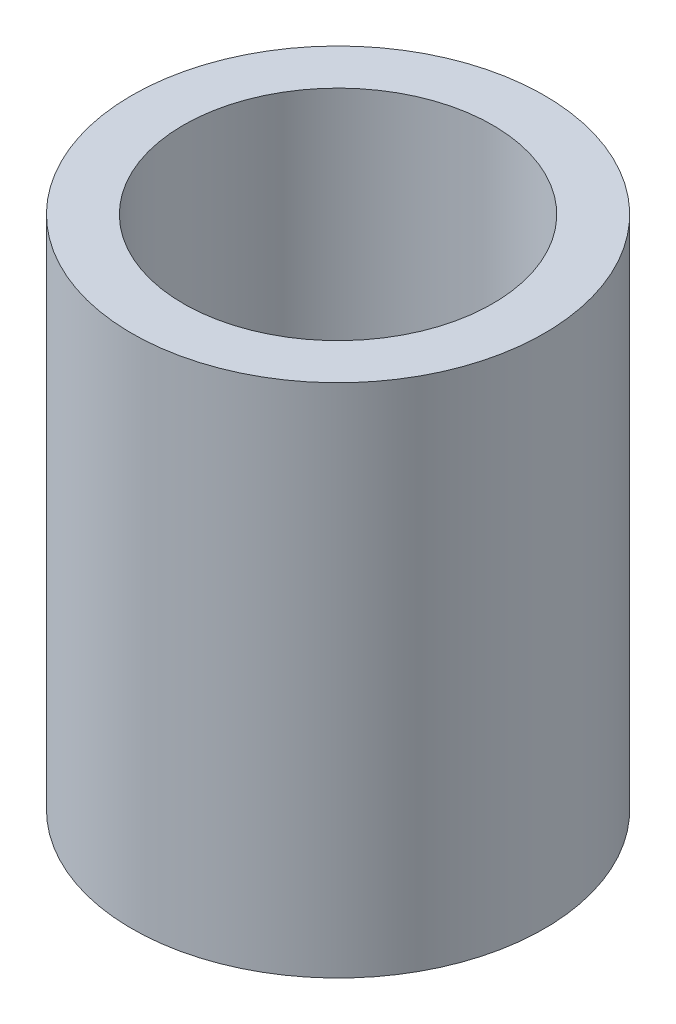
ISO-10303-21;
HEADER;
FILE_DESCRIPTION(('STEP AP214'),'2;1');
FILE_NAME('part.step','',(''),(''),'','','');
FILE_SCHEMA(('AUTOMOTIVE_DESIGN { 1 0 10303 214 1 1 1 1 }'));
ENDSEC;
DATA;
#1=APPLICATION_CONTEXT('core data for automotive mechanical design processes');
#2=APPLICATION_PROTOCOL_DEFINITION('international standard','automotive_design',2000,#1);
#3=PRODUCT_CONTEXT('',#1,'mechanical');
#4=PRODUCT('Part','Part','',(#3));
#5=PRODUCT_RELATED_PRODUCT_CATEGORY('part','',(#4));
#6=PRODUCT_DEFINITION_FORMATION('','',#4);
#7=PRODUCT_DEFINITION_CONTEXT('part definition',#1,'design');
#8=PRODUCT_DEFINITION('design','',#6,#7);
#9=PRODUCT_DEFINITION_SHAPE('','',#8);
#10=(LENGTH_UNIT() NAMED_UNIT(*) SI_UNIT(.MILLI.,.METRE.));
#11=(NAMED_UNIT(*) PLANE_ANGLE_UNIT() SI_UNIT($,.RADIAN.));
#12=(NAMED_UNIT(*) SI_UNIT($,.STERADIAN.) SOLID_ANGLE_UNIT());
#13=UNCERTAINTY_MEASURE_WITH_UNIT(LENGTH_MEASURE(1.E-05),#10,'distance_accuracy_value','');
#14=(GEOMETRIC_REPRESENTATION_CONTEXT(3) GLOBAL_UNCERTAINTY_ASSIGNED_CONTEXT((#13)) GLOBAL_UNIT_ASSIGNED_CONTEXT((#10,
#11,#12)) REPRESENTATION_CONTEXT('',''));
#15=CARTESIAN_POINT('',(0.,0.,0.));
#16=DIRECTION('',(0.,0.,1.));
#17=DIRECTION('',(1.,0.,0.));
#18=AXIS2_PLACEMENT_3D('',#15,#16,#17);
#19=CARTESIAN_POINT('',(0.,83.5390005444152,0.));
#20=DIRECTION('',(0.,1.,0.));
#21=DIRECTION('',(-1.,0.,0.));
#22=AXIS2_PLACEMENT_3D('',#19,#20,#21);
#23=CYLINDRICAL_SURFACE('',#22,15.);
#24=CARTESIAN_POINT('',(0.,0.,0.));
#25=DIRECTION('',(0.,1.,0.));
#26=DIRECTION('',(-1.,0.,0.));
#27=AXIS2_PLACEMENT_3D('',#24,#25,#26);
#28=CIRCLE('',#27,15.);
#29=CARTESIAN_POINT('',(-15.,0.,0.));
#30=VERTEX_POINT('',#29);
#31=EDGE_CURVE('E10',#30,#30,#28,.T.);
#32=ORIENTED_EDGE('',*,*,#31,.F.);
#33=EDGE_LOOP('',(#32));
#34=FACE_BOUND('',#33,.T.);
#35=CARTESIAN_POINT('',(0.,50.,0.));
#36=DIRECTION('',(0.,1.,0.));
#37=DIRECTION('',(-1.,0.,0.));
#38=AXIS2_PLACEMENT_3D('',#35,#36,#37);
#39=CIRCLE('',#38,15.);
#40=CARTESIAN_POINT('',(-15.,50.,0.));
#41=VERTEX_POINT('',#40);
#42=EDGE_CURVE('E42',#41,#41,#39,.T.);
#43=ORIENTED_EDGE('',*,*,#42,.T.);
#44=EDGE_LOOP('',(#43));
#45=FACE_BOUND('',#44,.T.);
#46=ADVANCED_FACE('F28',(#34,#45),#23,.F.);
#47=CARTESIAN_POINT('',(15.,0.,0.));
#48=DIRECTION('',(0.,1.,0.));
#49=DIRECTION('',(-1.,0.,0.));
#50=AXIS2_PLACEMENT_3D('',#47,#48,#49);
#51=PLANE('',#50);
#52=CARTESIAN_POINT('',(0.,0.,0.));
#53=DIRECTION('',(0.,1.,0.));
#54=DIRECTION('',(-1.,0.,0.));
#55=AXIS2_PLACEMENT_3D('',#52,#53,#54);
#56=CIRCLE('',#55,20.);
#57=CARTESIAN_POINT('',(-20.,0.,0.));
#58=VERTEX_POINT('',#57);
#59=EDGE_CURVE('E34',#58,#58,#56,.T.);
#60=ORIENTED_EDGE('',*,*,#59,.F.);
#61=EDGE_LOOP('',(#60));
#62=FACE_BOUND('',#61,.T.);
#63=ORIENTED_EDGE('',*,*,#31,.T.);
#64=EDGE_LOOP('',(#63));
#65=FACE_BOUND('',#64,.T.);
#66=ADVANCED_FACE('F57',(#62,#65),#51,.F.);
#67=CARTESIAN_POINT('',(0.,83.5390005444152,0.));
#68=DIRECTION('',(0.,1.,0.));
#69=DIRECTION('',(-1.,0.,0.));
#70=AXIS2_PLACEMENT_3D('',#67,#68,#69);
#71=CYLINDRICAL_SURFACE('',#70,20.);
#72=CARTESIAN_POINT('',(0.,50.,0.));
#73=DIRECTION('',(0.,1.,0.));
#74=DIRECTION('',(-1.,0.,0.));
#75=AXIS2_PLACEMENT_3D('',#72,#73,#74);
#76=CIRCLE('',#75,20.);
#77=CARTESIAN_POINT('',(-20.,50.,0.));
#78=VERTEX_POINT('',#77);
#79=EDGE_CURVE('E38',#78,#78,#76,.T.);
#80=ORIENTED_EDGE('',*,*,#79,.F.);
#81=EDGE_LOOP('',(#80));
#82=FACE_BOUND('',#81,.T.);
#83=ORIENTED_EDGE('',*,*,#59,.T.);
#84=EDGE_LOOP('',(#83));
#85=FACE_BOUND('',#84,.T.);
#86=ADVANCED_FACE('F52',(#82,#85),#71,.T.);
#87=CARTESIAN_POINT('',(15.,50.,0.));
#88=DIRECTION('',(0.,-1.,0.));
#89=DIRECTION('',(1.,0.,0.));
#90=AXIS2_PLACEMENT_3D('',#87,#88,#89);
#91=PLANE('',#90);
#92=ORIENTED_EDGE('',*,*,#42,.F.);
#93=EDGE_LOOP('',(#92));
#94=FACE_BOUND('',#93,.T.);
#95=ORIENTED_EDGE('',*,*,#79,.T.);
#96=EDGE_LOOP('',(#95));
#97=FACE_BOUND('',#96,.T.);
#98=ADVANCED_FACE('F49',(#94,#97),#91,.F.);
#99=CLOSED_SHELL('',(#46,#66,#86,#98));
#100=MANIFOLD_SOLID_BREP('B2',#99);
#101=ADVANCED_BREP_SHAPE_REPRESENTATION('',(#18,#100),#14);
#102=SHAPE_DEFINITION_REPRESENTATION(#9,#101);
ENDSEC;
END-ISO-10303-21;
